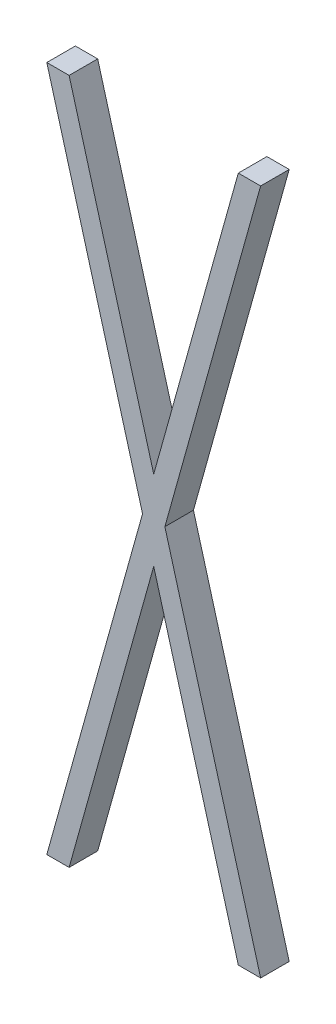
from build123d import *

# Parameters (mm, degrees)
EXTRUDE1_DEPTH = 3.175


with BuildPart() as part:
    # Sketch1 → Extrude1 (new body)
    with BuildSketch(Plane.XY):
        Polygon((1.541072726, -8.059889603), (-9.096357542, -46.159889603), (-6.617497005, -46.159889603), (2.780502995, -12.49914721), (12.178502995, -46.159889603), (14.657363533, -46.159889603), (4.019933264, -8.059889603), (14.657363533, 30.040110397), (12.178502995, 30.040110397), (2.780502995, -3.620631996), (-6.617497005, 30.040110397), (-9.096357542, 30.040110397), align=None)
    extrude(amount=EXTRUDE1_DEPTH)


solid = part.part
